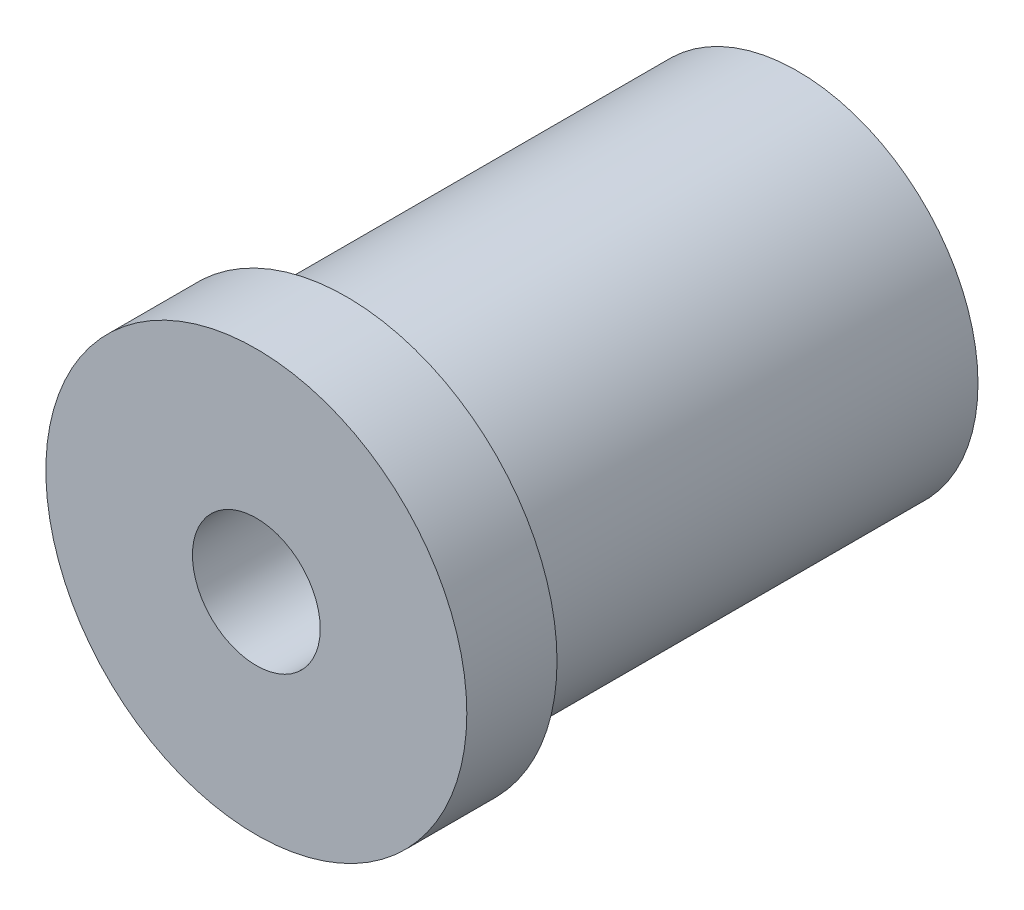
ISO-10303-21;
HEADER;
FILE_DESCRIPTION(('STEP AP214'),'2;1');
FILE_NAME('part.step','',(''),(''),'','','');
FILE_SCHEMA(('AUTOMOTIVE_DESIGN { 1 0 10303 214 1 1 1 1 }'));
ENDSEC;
DATA;
#1=APPLICATION_CONTEXT('core data for automotive mechanical design processes');
#2=APPLICATION_PROTOCOL_DEFINITION('international standard','automotive_design',2000,#1);
#3=PRODUCT_CONTEXT('',#1,'mechanical');
#4=PRODUCT('Part','Part','',(#3));
#5=PRODUCT_RELATED_PRODUCT_CATEGORY('part','',(#4));
#6=PRODUCT_DEFINITION_FORMATION('','',#4);
#7=PRODUCT_DEFINITION_CONTEXT('part definition',#1,'design');
#8=PRODUCT_DEFINITION('design','',#6,#7);
#9=PRODUCT_DEFINITION_SHAPE('','',#8);
#10=(LENGTH_UNIT() NAMED_UNIT(*) SI_UNIT(.MILLI.,.METRE.));
#11=(NAMED_UNIT(*) PLANE_ANGLE_UNIT() SI_UNIT($,.RADIAN.));
#12=(NAMED_UNIT(*) SI_UNIT($,.STERADIAN.) SOLID_ANGLE_UNIT());
#13=UNCERTAINTY_MEASURE_WITH_UNIT(LENGTH_MEASURE(1.E-05),#10,'distance_accuracy_value','');
#14=(GEOMETRIC_REPRESENTATION_CONTEXT(3) GLOBAL_UNCERTAINTY_ASSIGNED_CONTEXT((#13)) GLOBAL_UNIT_ASSIGNED_CONTEXT((#10,
#11,#12)) REPRESENTATION_CONTEXT('',''));
#15=CARTESIAN_POINT('',(0.,0.,0.));
#16=DIRECTION('',(0.,0.,1.));
#17=DIRECTION('',(1.,0.,0.));
#18=AXIS2_PLACEMENT_3D('',#15,#16,#17);
#19=CARTESIAN_POINT('',(0.,4.25,-8.));
#20=DIRECTION('',(0.,0.,-1.));
#21=DIRECTION('',(-1.,0.,0.));
#22=AXIS2_PLACEMENT_3D('',#19,#20,#21);
#23=PLANE('',#22);
#24=CARTESIAN_POINT('',(0.,0.,-8.));
#25=DIRECTION('',(0.,0.,1.));
#26=DIRECTION('',(1.,0.,0.));
#27=AXIS2_PLACEMENT_3D('',#24,#25,#26);
#28=CIRCLE('',#27,4.);
#29=CARTESIAN_POINT('',(4.,0.,-8.));
#30=VERTEX_POINT('',#29);
#31=EDGE_CURVE('E51',#30,#30,#28,.T.);
#32=ORIENTED_EDGE('',*,*,#31,.F.);
#33=EDGE_LOOP('',(#32));
#34=FACE_BOUND('',#33,.T.);
#35=CARTESIAN_POINT('',(0.,0.,-8.));
#36=DIRECTION('',(0.,0.,1.));
#37=DIRECTION('',(1.,0.,0.));
#38=AXIS2_PLACEMENT_3D('',#35,#36,#37);
#39=CIRCLE('',#38,4.25);
#40=CARTESIAN_POINT('',(4.25,0.,-8.));
#41=VERTEX_POINT('',#40);
#42=EDGE_CURVE('E9',#41,#41,#39,.T.);
#43=ORIENTED_EDGE('',*,*,#42,.T.);
#44=EDGE_LOOP('',(#43));
#45=FACE_BOUND('',#44,.T.);
#46=ADVANCED_FACE('F14',(#34,#45),#23,.F.);
#47=CARTESIAN_POINT('',(0.,0.,0.));
#48=DIRECTION('',(0.,0.,1.));
#49=DIRECTION('',(1.,0.,0.));
#50=AXIS2_PLACEMENT_3D('',#47,#48,#49);
#51=CYLINDRICAL_SURFACE('',#50,4.25);
#52=ORIENTED_EDGE('',*,*,#42,.F.);
#53=EDGE_LOOP('',(#52));
#54=FACE_BOUND('',#53,.T.);
#55=CARTESIAN_POINT('',(0.,0.,0.));
#56=DIRECTION('',(0.,0.,1.));
#57=DIRECTION('',(1.,0.,0.));
#58=AXIS2_PLACEMENT_3D('',#55,#56,#57);
#59=CIRCLE('',#58,4.25);
#60=CARTESIAN_POINT('',(4.25,0.,0.));
#61=VERTEX_POINT('',#60);
#62=EDGE_CURVE('E20',#61,#61,#59,.T.);
#63=ORIENTED_EDGE('',*,*,#62,.T.);
#64=EDGE_LOOP('',(#63));
#65=FACE_BOUND('',#64,.T.);
#66=ADVANCED_FACE('F58',(#54,#65),#51,.F.);
#67=CARTESIAN_POINT('',(0.,4.25,0.));
#68=DIRECTION('',(0.,0.,-1.));
#69=DIRECTION('',(-1.,0.,0.));
#70=AXIS2_PLACEMENT_3D('',#67,#68,#69);
#71=PLANE('',#70);
#72=ORIENTED_EDGE('',*,*,#62,.F.);
#73=EDGE_LOOP('',(#72));
#74=FACE_BOUND('',#73,.T.);
#75=CARTESIAN_POINT('',(0.,0.,0.));
#76=DIRECTION('',(0.,0.,1.));
#77=DIRECTION('',(1.,0.,0.));
#78=AXIS2_PLACEMENT_3D('',#75,#76,#77);
#79=CIRCLE('',#78,14.);
#80=CARTESIAN_POINT('',(14.,0.,0.));
#81=VERTEX_POINT('',#80);
#82=EDGE_CURVE('E24',#81,#81,#79,.T.);
#83=ORIENTED_EDGE('',*,*,#82,.T.);
#84=EDGE_LOOP('',(#83));
#85=FACE_BOUND('',#84,.T.);
#86=ADVANCED_FACE('F64',(#74,#85),#71,.F.);
#87=CARTESIAN_POINT('',(0.,0.,0.));
#88=DIRECTION('',(0.,0.,1.));
#89=DIRECTION('',(1.,0.,0.));
#90=AXIS2_PLACEMENT_3D('',#87,#88,#89);
#91=CYLINDRICAL_SURFACE('',#90,14.);
#92=ORIENTED_EDGE('',*,*,#82,.F.);
#93=EDGE_LOOP('',(#92));
#94=FACE_BOUND('',#93,.T.);
#95=CARTESIAN_POINT('',(0.,0.,-6.));
#96=DIRECTION('',(0.,0.,1.));
#97=DIRECTION('',(1.,0.,0.));
#98=AXIS2_PLACEMENT_3D('',#95,#96,#97);
#99=CIRCLE('',#98,14.);
#100=CARTESIAN_POINT('',(14.,0.,-6.));
#101=VERTEX_POINT('',#100);
#102=EDGE_CURVE('E28',#101,#101,#99,.T.);
#103=ORIENTED_EDGE('',*,*,#102,.T.);
#104=EDGE_LOOP('',(#103));
#105=FACE_BOUND('',#104,.T.);
#106=ADVANCED_FACE('F70',(#94,#105),#91,.T.);
#107=CARTESIAN_POINT('',(0.,14.,-6.));
#108=DIRECTION('',(0.,0.,1.));
#109=DIRECTION('',(1.,0.,0.));
#110=AXIS2_PLACEMENT_3D('',#107,#108,#109);
#111=PLANE('',#110);
#112=ORIENTED_EDGE('',*,*,#102,.F.);
#113=EDGE_LOOP('',(#112));
#114=FACE_BOUND('',#113,.T.);
#115=CARTESIAN_POINT('',(0.,0.,-6.));
#116=DIRECTION('',(0.,0.,1.));
#117=DIRECTION('',(1.,0.,0.));
#118=AXIS2_PLACEMENT_3D('',#115,#116,#117);
#119=CIRCLE('',#118,12.);
#120=CARTESIAN_POINT('',(12.,0.,-6.));
#121=VERTEX_POINT('',#120);
#122=EDGE_CURVE('E33',#121,#121,#119,.T.);
#123=ORIENTED_EDGE('',*,*,#122,.T.);
#124=EDGE_LOOP('',(#123));
#125=FACE_BOUND('',#124,.T.);
#126=ADVANCED_FACE('F76',(#114,#125),#111,.F.);
#127=CARTESIAN_POINT('',(0.,0.,0.));
#128=DIRECTION('',(0.,0.,1.));
#129=DIRECTION('',(1.,0.,0.));
#130=AXIS2_PLACEMENT_3D('',#127,#128,#129);
#131=CYLINDRICAL_SURFACE('',#130,12.);
#132=ORIENTED_EDGE('',*,*,#122,.F.);
#133=EDGE_LOOP('',(#132));
#134=FACE_BOUND('',#133,.T.);
#135=CARTESIAN_POINT('',(0.,0.,-36.));
#136=DIRECTION('',(0.,0.,1.));
#137=DIRECTION('',(1.,0.,0.));
#138=AXIS2_PLACEMENT_3D('',#135,#136,#137);
#139=CIRCLE('',#138,12.);
#140=CARTESIAN_POINT('',(12.,0.,-36.));
#141=VERTEX_POINT('',#140);
#142=EDGE_CURVE('E36',#141,#141,#139,.T.);
#143=ORIENTED_EDGE('',*,*,#142,.T.);
#144=EDGE_LOOP('',(#143));
#145=FACE_BOUND('',#144,.T.);
#146=ADVANCED_FACE('F80',(#134,#145),#131,.T.);
#147=CARTESIAN_POINT('',(0.,12.,-36.));
#148=DIRECTION('',(0.,0.,1.));
#149=DIRECTION('',(1.,0.,0.));
#150=AXIS2_PLACEMENT_3D('',#147,#148,#149);
#151=PLANE('',#150);
#152=ORIENTED_EDGE('',*,*,#142,.F.);
#153=EDGE_LOOP('',(#152));
#154=FACE_BOUND('',#153,.T.);
#155=CARTESIAN_POINT('',(0.,0.,-36.));
#156=DIRECTION('',(0.,0.,1.));
#157=DIRECTION('',(1.,0.,0.));
#158=AXIS2_PLACEMENT_3D('',#155,#156,#157);
#159=CIRCLE('',#158,4.1);
#160=CARTESIAN_POINT('',(4.1,0.,-36.));
#161=VERTEX_POINT('',#160);
#162=EDGE_CURVE('E39',#161,#161,#159,.T.);
#163=ORIENTED_EDGE('',*,*,#162,.T.);
#164=EDGE_LOOP('',(#163));
#165=FACE_BOUND('',#164,.T.);
#166=ADVANCED_FACE('F84',(#154,#165),#151,.F.);
#167=CARTESIAN_POINT('',(0.,0.,0.));
#168=DIRECTION('',(0.,0.,1.));
#169=DIRECTION('',(1.,0.,0.));
#170=AXIS2_PLACEMENT_3D('',#167,#168,#169);
#171=CYLINDRICAL_SURFACE('',#170,4.1);
#172=ORIENTED_EDGE('',*,*,#162,.F.);
#173=EDGE_LOOP('',(#172));
#174=FACE_BOUND('',#173,.T.);
#175=CARTESIAN_POINT('',(0.,0.,-34.));
#176=DIRECTION('',(0.,0.,1.));
#177=DIRECTION('',(1.,0.,0.));
#178=AXIS2_PLACEMENT_3D('',#175,#176,#177);
#179=CIRCLE('',#178,4.1);
#180=CARTESIAN_POINT('',(4.1,0.,-34.));
#181=VERTEX_POINT('',#180);
#182=EDGE_CURVE('E42',#181,#181,#179,.T.);
#183=ORIENTED_EDGE('',*,*,#182,.T.);
#184=EDGE_LOOP('',(#183));
#185=FACE_BOUND('',#184,.T.);
#186=ADVANCED_FACE('F88',(#174,#185),#171,.F.);
#187=CARTESIAN_POINT('',(0.,0.,-26.5));
#188=DIRECTION('',(0.,0.,1.));
#189=DIRECTION('',(1.,0.,0.));
#190=AXIS2_PLACEMENT_3D('',#187,#188,#189);
#191=CONICAL_SURFACE('',#190,4.75616497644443,0.0872664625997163);
#192=ORIENTED_EDGE('',*,*,#182,.F.);
#193=EDGE_LOOP('',(#192));
#194=FACE_BOUND('',#193,.T.);
#195=CARTESIAN_POINT('',(0.,0.,-26.5));
#196=DIRECTION('',(0.,0.,1.));
#197=DIRECTION('',(1.,0.,0.));
#198=AXIS2_PLACEMENT_3D('',#195,#196,#197);
#199=CIRCLE('',#198,4.75616497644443);
#200=CARTESIAN_POINT('',(4.75616497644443,0.,-26.5));
#201=VERTEX_POINT('',#200);
#202=EDGE_CURVE('E45',#201,#201,#199,.T.);
#203=ORIENTED_EDGE('',*,*,#202,.T.);
#204=EDGE_LOOP('',(#203));
#205=FACE_BOUND('',#204,.T.);
#206=ADVANCED_FACE('F92',(#194,#205),#191,.F.);
#207=CARTESIAN_POINT('',(0.,4.75616497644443,-26.5));
#208=DIRECTION('',(0.,0.,1.));
#209=DIRECTION('',(1.,0.,0.));
#210=AXIS2_PLACEMENT_3D('',#207,#208,#209);
#211=PLANE('',#210);
#212=ORIENTED_EDGE('',*,*,#202,.F.);
#213=EDGE_LOOP('',(#212));
#214=FACE_BOUND('',#213,.T.);
#215=CARTESIAN_POINT('',(0.,0.,-26.5));
#216=DIRECTION('',(0.,0.,1.));
#217=DIRECTION('',(1.,0.,0.));
#218=AXIS2_PLACEMENT_3D('',#215,#216,#217);
#219=CIRCLE('',#218,4.);
#220=CARTESIAN_POINT('',(4.,0.,-26.5));
#221=VERTEX_POINT('',#220);
#222=EDGE_CURVE('E48',#221,#221,#219,.T.);
#223=ORIENTED_EDGE('',*,*,#222,.T.);
#224=EDGE_LOOP('',(#223));
#225=FACE_BOUND('',#224,.T.);
#226=ADVANCED_FACE('F96',(#214,#225),#211,.F.);
#227=CARTESIAN_POINT('',(0.,0.,0.));
#228=DIRECTION('',(0.,0.,1.));
#229=DIRECTION('',(1.,0.,0.));
#230=AXIS2_PLACEMENT_3D('',#227,#228,#229);
#231=CYLINDRICAL_SURFACE('',#230,4.);
#232=ORIENTED_EDGE('',*,*,#222,.F.);
#233=EDGE_LOOP('',(#232));
#234=FACE_BOUND('',#233,.T.);
#235=ORIENTED_EDGE('',*,*,#31,.T.);
#236=EDGE_LOOP('',(#235));
#237=FACE_BOUND('',#236,.T.);
#238=ADVANCED_FACE('F55',(#234,#237),#231,.F.);
#239=CLOSED_SHELL('',(#46,#66,#86,#106,#126,#146,#166,#186,#206,#226,#238));
#240=MANIFOLD_SOLID_BREP('B1',#239);
#241=ADVANCED_BREP_SHAPE_REPRESENTATION('',(#18,#240),#14);
#242=SHAPE_DEFINITION_REPRESENTATION(#9,#241);
ENDSEC;
END-ISO-10303-21;
